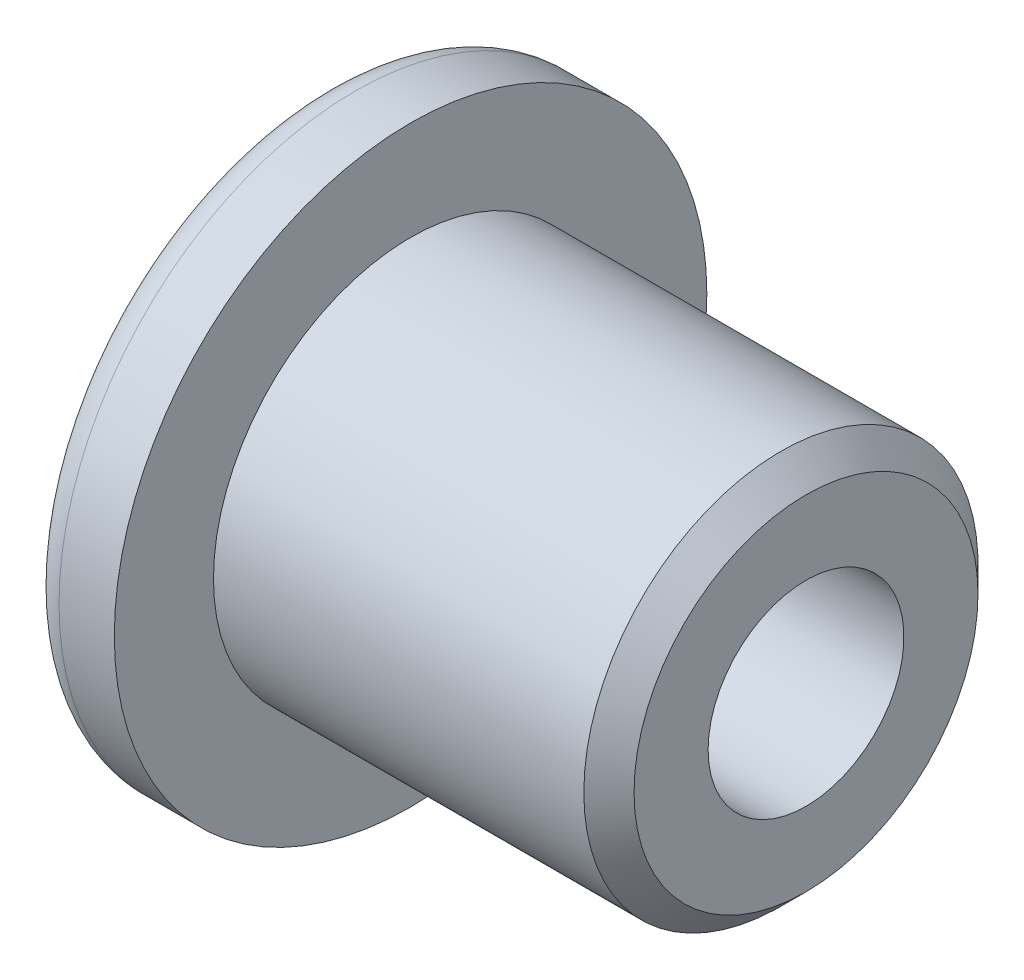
from build123d import *

# Parameters (mm, degrees)
CUT_EXTRUDE1_DEPTH = 5.08
FILLET1_R          = 0.635
CHAMFER1_SIZE      = 0.508


with BuildPart() as part:
    # Sketch1 → Revolve1 (revolve)
    with BuildSketch(Plane.XY, mode=Mode.PRIVATE) as revolve1_sk:
        Polygon((0, 1.9812), (0, 3.81), (1.016, 5.9944), (2.54, 5.9944), (2.54, 3.9878), (10.541, 3.9878), (10.541, 1.9812), align=None)
    revolve(revolve1_sk.sketch.rotate(Axis((0, 0, 0), (1, 0, 0)), 90), axis=Axis((0, 0, 0), (1, 0, 0)))

    # Sketch2 → Cut-Extrude1 (cut)
    with BuildSketch(Plane(origin=(0, 0, 0), x_dir=(0, 0, -1), z_dir=(1, 0, 0))):
        Polygon((-1.43714029, -2.4892), (1.43714029, -2.4892), (2.87428058, 0), (1.43714029, 2.4892), (-1.43714029, 2.4892), (-2.87428058, 0), align=None)
    extrude(amount=CUT_EXTRUDE1_DEPTH, mode=Mode.SUBTRACT)

    # Fillet1
    fillet1_edges = [part.edges().sort_by_distance(p)[0] for p in [
        (1.016, 0, -5.9944),
    ]]
    fillet(fillet1_edges, radius=FILLET1_R)

    # Chamfer1
    chamfer1_edges = [part.edges().sort_by_distance(p)[0] for p in [
        (10.541, 0, -3.9878),
    ]]
    chamfer(chamfer1_edges, length=CHAMFER1_SIZE)


solid = part.part
